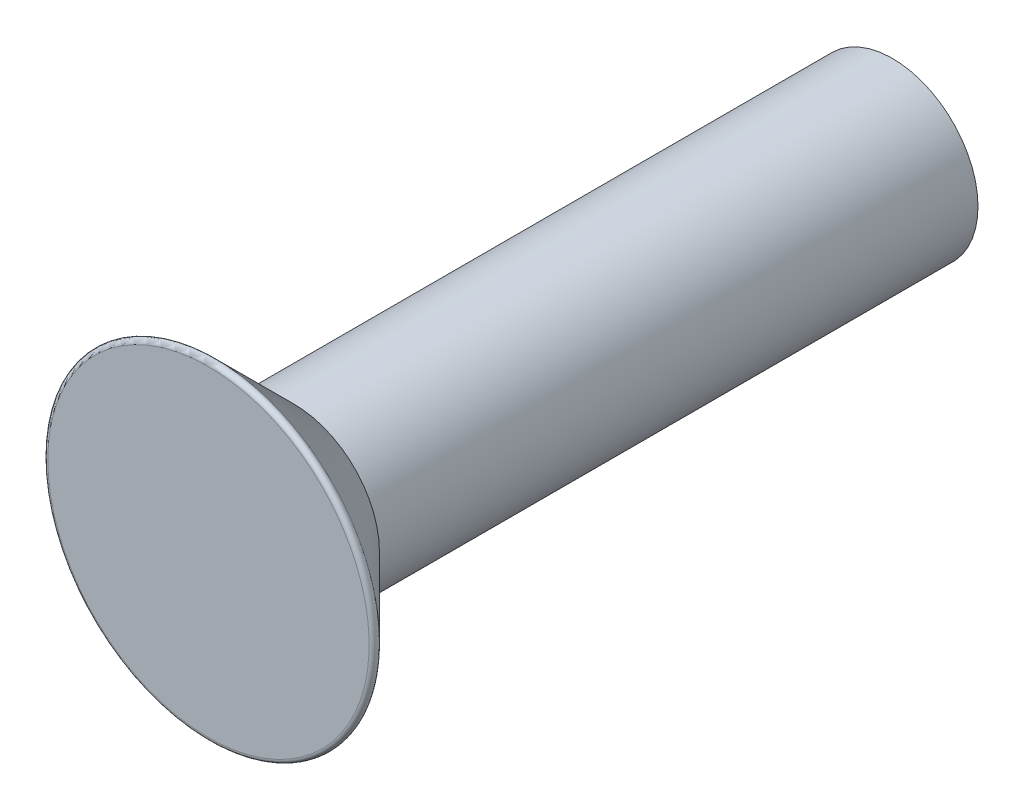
ISO-10303-21;
HEADER;
FILE_DESCRIPTION(('STEP AP214'),'2;1');
FILE_NAME('part.step','',(''),(''),'','','');
FILE_SCHEMA(('AUTOMOTIVE_DESIGN { 1 0 10303 214 1 1 1 1 }'));
ENDSEC;
DATA;
#1=APPLICATION_CONTEXT('core data for automotive mechanical design processes');
#2=APPLICATION_PROTOCOL_DEFINITION('international standard','automotive_design',2000,#1);
#3=PRODUCT_CONTEXT('',#1,'mechanical');
#4=PRODUCT('Part','Part','',(#3));
#5=PRODUCT_RELATED_PRODUCT_CATEGORY('part','',(#4));
#6=PRODUCT_DEFINITION_FORMATION('','',#4);
#7=PRODUCT_DEFINITION_CONTEXT('part definition',#1,'design');
#8=PRODUCT_DEFINITION('design','',#6,#7);
#9=PRODUCT_DEFINITION_SHAPE('','',#8);
#10=(LENGTH_UNIT() NAMED_UNIT(*) SI_UNIT(.MILLI.,.METRE.));
#11=(NAMED_UNIT(*) PLANE_ANGLE_UNIT() SI_UNIT($,.RADIAN.));
#12=(NAMED_UNIT(*) SI_UNIT($,.STERADIAN.) SOLID_ANGLE_UNIT());
#13=UNCERTAINTY_MEASURE_WITH_UNIT(LENGTH_MEASURE(1.E-05),#10,'distance_accuracy_value','');
#14=(GEOMETRIC_REPRESENTATION_CONTEXT(3) GLOBAL_UNCERTAINTY_ASSIGNED_CONTEXT((#13)) GLOBAL_UNIT_ASSIGNED_CONTEXT((#10,
#11,#12)) REPRESENTATION_CONTEXT('',''));
#15=CARTESIAN_POINT('',(0.,0.,0.));
#16=DIRECTION('',(0.,0.,1.));
#17=DIRECTION('',(1.,0.,0.));
#18=AXIS2_PLACEMENT_3D('',#15,#16,#17);
#19=CARTESIAN_POINT('',(0.,0.,-25.4));
#20=DIRECTION('',(0.,0.,1.));
#21=DIRECTION('',(1.,0.,0.));
#22=AXIS2_PLACEMENT_3D('',#19,#20,#21);
#23=PLANE('',#22);
#24=CARTESIAN_POINT('',(0.,0.,-25.4));
#25=DIRECTION('',(0.,0.,1.));
#26=DIRECTION('',(1.,0.,0.));
#27=AXIS2_PLACEMENT_3D('',#24,#25,#26);
#28=CIRCLE('',#27,3.175);
#29=CARTESIAN_POINT('',(3.175,0.,-25.4));
#30=VERTEX_POINT('',#29);
#31=EDGE_CURVE('E42',#30,#30,#28,.T.);
#32=ORIENTED_EDGE('',*,*,#31,.F.);
#33=EDGE_LOOP('',(#32));
#34=FACE_BOUND('',#33,.T.);
#35=ADVANCED_FACE('F31',(#34),#23,.F.);
#36=CARTESIAN_POINT('',(0.,0.,0.));
#37=DIRECTION('',(0.,0.,1.));
#38=DIRECTION('',(1.,0.,0.));
#39=AXIS2_PLACEMENT_3D('',#36,#37,#38);
#40=CYLINDRICAL_SURFACE('',#39,3.175);
#41=CARTESIAN_POINT('',(0.,0.,-3.175));
#42=DIRECTION('',(0.,0.,1.));
#43=DIRECTION('',(1.,0.,0.));
#44=AXIS2_PLACEMENT_3D('',#41,#42,#43);
#45=CIRCLE('',#44,3.175);
#46=CARTESIAN_POINT('',(3.175,0.,-3.175));
#47=VERTEX_POINT('',#46);
#48=EDGE_CURVE('E46',#47,#47,#45,.T.);
#49=ORIENTED_EDGE('',*,*,#48,.F.);
#50=EDGE_LOOP('',(#49));
#51=FACE_BOUND('',#50,.T.);
#52=ORIENTED_EDGE('',*,*,#31,.T.);
#53=EDGE_LOOP('',(#52));
#54=FACE_BOUND('',#53,.T.);
#55=ADVANCED_FACE('F54',(#51,#54),#40,.T.);
#56=CARTESIAN_POINT('',(0.,0.,-3.175));
#57=DIRECTION('',(0.,0.,1.));
#58=DIRECTION('',(1.,0.,0.));
#59=AXIS2_PLACEMENT_3D('',#56,#57,#58);
#60=CONICAL_SURFACE('',#59,3.175,0.785398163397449);
#61=CARTESIAN_POINT('',(0.,0.,-0.271003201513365));
#62=DIRECTION('',(0.,0.,-1.));
#63=DIRECTION('',(-1.,0.,0.));
#64=AXIS2_PLACEMENT_3D('',#61,#62,#63);
#65=CIRCLE('',#64,6.07899679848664);
#66=CARTESIAN_POINT('',(-6.07899679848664,0.,-0.271003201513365));
#67=VERTEX_POINT('',#66);
#68=EDGE_CURVE('E10',#67,#67,#65,.T.);
#69=ORIENTED_EDGE('',*,*,#68,.T.);
#70=EDGE_LOOP('',(#69));
#71=FACE_BOUND('',#70,.T.);
#72=ORIENTED_EDGE('',*,*,#48,.T.);
#73=EDGE_LOOP('',(#72));
#74=FACE_BOUND('',#73,.T.);
#75=ADVANCED_FACE('F52',(#71,#74),#60,.T.);
#76=CARTESIAN_POINT('',(0.,0.,0.));
#77=DIRECTION('',(0.,0.,-1.));
#78=DIRECTION('',(-1.,0.,0.));
#79=AXIS2_PLACEMENT_3D('',#76,#77,#78);
#80=PLANE('',#79);
#81=CARTESIAN_POINT('',(0.,0.,0.));
#82=DIRECTION('',(0.,0.,-1.));
#83=DIRECTION('',(-1.,0.,0.));
#84=AXIS2_PLACEMENT_3D('',#81,#82,#83);
#85=CIRCLE('',#84,5.96674359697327);
#86=CARTESIAN_POINT('',(-5.96674359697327,0.,0.));
#87=VERTEX_POINT('',#86);
#88=EDGE_CURVE('E38',#87,#87,#85,.F.);
#89=ORIENTED_EDGE('',*,*,#88,.T.);
#90=EDGE_LOOP('',(#89));
#91=FACE_BOUND('',#90,.T.);
#92=ADVANCED_FACE('F66',(#91),#80,.F.);
#93=CARTESIAN_POINT('',(0.,0.,-0.15875));
#94=DIRECTION('',(0.,0.,-1.));
#95=DIRECTION('',(-1.,0.,0.));
#96=AXIS2_PLACEMENT_3D('',#93,#94,#95);
#97=TOROIDAL_SURFACE('',#96,5.96674359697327,0.15875);
#98=ORIENTED_EDGE('',*,*,#68,.F.);
#99=EDGE_LOOP('',(#98));
#100=FACE_BOUND('',#99,.T.);
#101=ORIENTED_EDGE('',*,*,#88,.F.);
#102=EDGE_LOOP('',(#101));
#103=FACE_BOUND('',#102,.T.);
#104=ADVANCED_FACE('F33',(#100,#103),#97,.T.);
#105=CLOSED_SHELL('',(#35,#55,#75,#92,#104));
#106=MANIFOLD_SOLID_BREP('B2',#105);
#107=ADVANCED_BREP_SHAPE_REPRESENTATION('',(#18,#106),#14);
#108=SHAPE_DEFINITION_REPRESENTATION(#9,#107);
ENDSEC;
END-ISO-10303-21;
